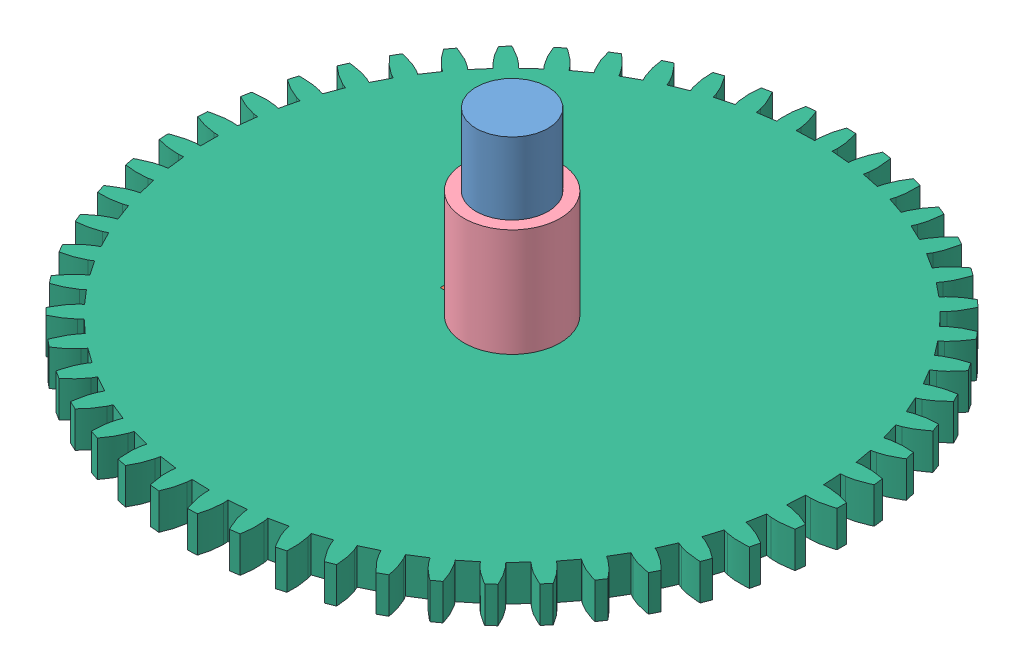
SolidWorks assembly Axle Assembly F.SLDASM, configuration Default (file format 6000). Lengths in mm.
Overall size (27.49 16.5 27.5).
7 component instances, 6 part files, 19 mates.
Components (placement in the parent):
- Axle F-1: Axle F.SLDPRT [Default] at (-23.9628 0.9294 4.0883) size (3 16.5 3)
- Key-1: Key.SLDPRT [Default] at (-23.9628 8.4294 4.0883) x (-1 0 0) z (0 0 1) size (2 1.5 1)
- Key-2: Key.SLDPRT [Default] at (-23.9628 9.9294 4.0883) x (-1 0 0) z (0 0 1) size (2 1.5 1)
- Spacer 3mm-1: Spacer 3mm.SLDPRT [Default] at (-22.4628 3.9294 4.0883) x (0 0 -1) z (1 0 0) size (4 3 4)
- Spacer 4.5mm-1: Spacer 4.5mm.SLDPRT [Default] at (-22.4628 9.9294 4.0883) size (4 4.5 4)
- Gear 30T-1: Gear 30T.sldprt [Default] at (-22.4628 8.4294 4.0883) x (0 0 1) z (1 0 0) size (15.99 1.5 15.99)
- Gear 53T-1: Gear 53T.sldprt [Default] at (-22.4628 8.4294 4.0883) x (0 0 -1) z (1 0 0) size (27.5 1.5 27.49)
Mates (geometry in assembly coordinates):
- Coincident1: coincident anti-aligned: plane of Axle F-1 through (-22.9628 0.9294 4.0883) normal (-1 0 0); plane of Key-1 through (-22.9628 6.9294 4.5883) normal (1 0 0)
- Coincident2: coincident anti-aligned: plane of Axle F-1 through (-22.9628 6.9294 3.5883) normal (0 0 1); plane of Key-1 through (-22.9628 6.9294 3.5883) normal (0 0 -1)
- Coincident3: coincident anti-aligned: plane of Axle F-1 through (-22.9628 6.9294 3.5883) normal (0 1 0); plane of Key-1 through (-23.9628 6.9294 4.0883) normal (0 -1 0)
- Coincident4: coincident anti-aligned: plane of Key-1 through (-23.9628 8.4294 4.0883) normal (0 1 0); plane of Key-2 through (-23.9628 8.4294 4.0883) normal (0 -1 0)
- Coincident5: coincident anti-aligned: plane of Axle F-1 through (-22.9628 6.9294 4.5883) normal (0 0 -1); plane of Key-2 through (-22.9628 8.4294 4.5883) normal (0 0 1)
- Coincident6: coincident anti-aligned: plane of Axle F-1 through (-22.9628 9.9294 3.5883) normal (0 -1 0); plane of Key-2 through (-23.9628 9.9294 4.0883) normal (0 1 0)
- Coincident7: coincident anti-aligned: plane of Axle F-1 through (-22.9628 0.9294 4.0883) normal (-1 0 0); plane of Key-2 through (-22.9628 8.4294 4.5883) normal (1 0 0)
- Concentric4: concentric aligned: cylinder of Axle F-1 through (-22.4628 17.4294 4.0883) axis (0 -1 0) radius 1.5; cylinder of Spacer 3mm-1 through (-22.4628 6.9294 4.0883) axis (0 -1 0) radius 1.5
- Concentric5: concentric aligned: cylinder of Axle F-1 through (-22.4628 17.4294 4.0883) axis (0 -1 0) radius 1.5; cylinder of Spacer 4.5mm-1 through (-22.4628 14.4294 4.0883) axis (0 -1 0) radius 1.5
- Parallel3: parallel anti-aligned: line of Key-2 through (-24.9628 9.9294 4.5883) axis (0 0 -1); line of Spacer 4.5mm-1 through (-22.4628 9.9294 4.0883) axis (0 0 1)
- Coincident8: coincident anti-aligned: plane of Key-1 through (-23.9628 6.9294 4.0883) normal (0 -1 0); plane of Spacer 3mm-1 through (-22.4628 6.9294 4.0883) normal (0 1 0)
- Coincident9: coincident anti-aligned: plane of Key-2 through (-23.9628 9.9294 4.0883) normal (0 1 0); plane of Spacer 4.5mm-1 through (-22.4628 9.9294 4.0883) normal (0 -1 0)
- Parallel4: parallel anti-aligned: line of Key-1 through (-22.9628 6.9294 4.5883) axis (-1 0 0); line of Spacer 3mm-1 through (-22.4628 3.9294 4.0883) axis (1 0 0)
- Coincident10: coincident aligned: plane of Key-2 through (-23.9628 9.9294 4.0883) normal (0 1 0); plane of Gear 53T-1 through (-17.5788 9.9294 22.6097) normal (0 1 0)
- Concentric6: concentric aligned: cylinder of Axle F-1 through (-22.4628 17.4294 4.0883) axis (0 -1 0) radius 1.5; cylinder of Gear 53T-1 through (-22.4628 9.9294 4.0883) axis (0 -1 0) radius 1.5
- Coincident11: coincident anti-aligned: line of Key-2 through (-24.9628 9.9294 4.5883) axis (0 0 -1); line of Gear 53T-1 through (-24.9628 9.9294 3.5883) axis (0 0 1)
- Coincident12: coincident aligned: plane of Key-1 through (-23.9628 6.9294 4.0883) normal (0 -1 0); plane of Gear 30T-1 through (-19.9271 6.9294 -6.1292) normal (0 -1 0)
- Concentric7: concentric anti-aligned: cylinder of Axle F-1 through (-22.4628 17.4294 4.0883) axis (0 -1 0) radius 1.5; cylinder of Gear 30T-1 through (-22.4628 6.9294 4.0883) axis (0 1 0) radius 1.5
- Parallel5: parallel aligned: line of Key-1 through (-24.9628 6.9294 4.5883) axis (0 0 -1); line of Gear 30T-1 through (-24.9628 6.9294 4.5883) axis (0 0 -1)
